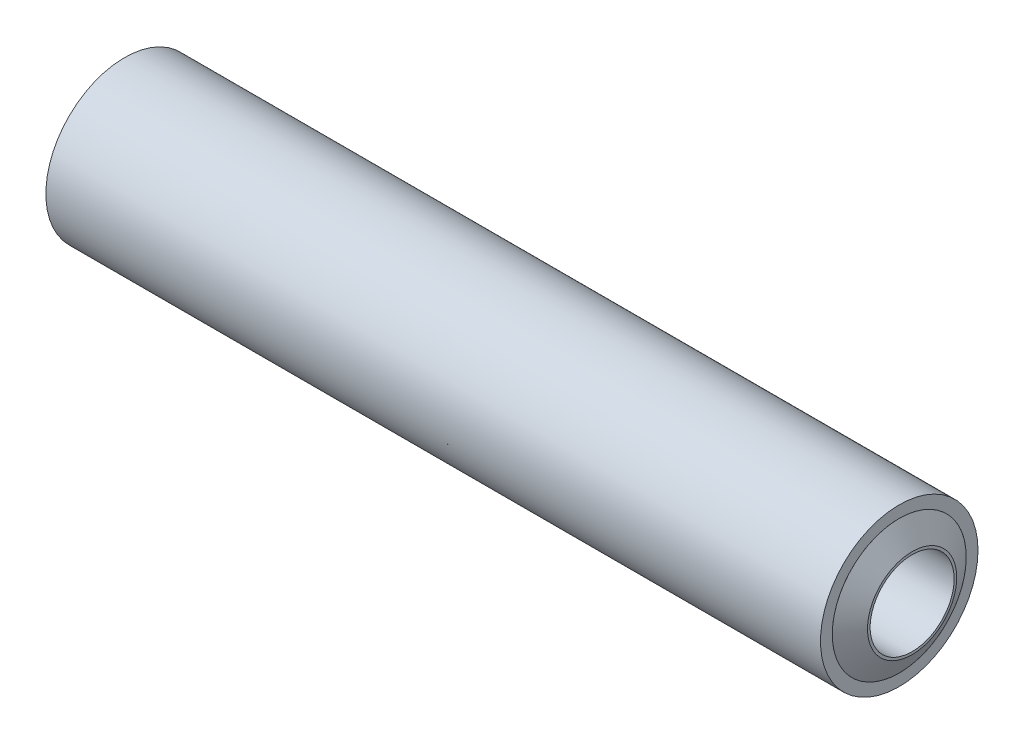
ISO-10303-21;
HEADER;
FILE_DESCRIPTION(('STEP AP214'),'2;1');
FILE_NAME('part.step','',(''),(''),'','','');
FILE_SCHEMA(('AUTOMOTIVE_DESIGN { 1 0 10303 214 1 1 1 1 }'));
ENDSEC;
DATA;
#1=APPLICATION_CONTEXT('core data for automotive mechanical design processes');
#2=APPLICATION_PROTOCOL_DEFINITION('international standard','automotive_design',2000,#1);
#3=PRODUCT_CONTEXT('',#1,'mechanical');
#4=PRODUCT('Part','Part','',(#3));
#5=PRODUCT_RELATED_PRODUCT_CATEGORY('part','',(#4));
#6=PRODUCT_DEFINITION_FORMATION('','',#4);
#7=PRODUCT_DEFINITION_CONTEXT('part definition',#1,'design');
#8=PRODUCT_DEFINITION('design','',#6,#7);
#9=PRODUCT_DEFINITION_SHAPE('','',#8);
#10=(LENGTH_UNIT() NAMED_UNIT(*) SI_UNIT(.MILLI.,.METRE.));
#11=(NAMED_UNIT(*) PLANE_ANGLE_UNIT() SI_UNIT($,.RADIAN.));
#12=(NAMED_UNIT(*) SI_UNIT($,.STERADIAN.) SOLID_ANGLE_UNIT());
#13=UNCERTAINTY_MEASURE_WITH_UNIT(LENGTH_MEASURE(1.E-05),#10,'distance_accuracy_value','');
#14=(GEOMETRIC_REPRESENTATION_CONTEXT(3) GLOBAL_UNCERTAINTY_ASSIGNED_CONTEXT((#13)) GLOBAL_UNIT_ASSIGNED_CONTEXT((#10,
#11,#12)) REPRESENTATION_CONTEXT('',''));
#15=CARTESIAN_POINT('',(0.,0.,0.));
#16=DIRECTION('',(0.,0.,1.));
#17=DIRECTION('',(1.,0.,0.));
#18=AXIS2_PLACEMENT_3D('',#15,#16,#17);
#19=CARTESIAN_POINT('',(-15.,0.,0.));
#20=DIRECTION('',(1.,0.,0.));
#21=DIRECTION('',(0.,0.,-1.));
#22=AXIS2_PLACEMENT_3D('',#19,#20,#21);
#23=CYLINDRICAL_SURFACE('',#22,3.);
#24=CARTESIAN_POINT('',(14.50925227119,0.,0.));
#25=DIRECTION('',(1.,0.,0.));
#26=DIRECTION('',(0.,0.,-1.));
#27=AXIS2_PLACEMENT_3D('',#24,#25,#26);
#28=CIRCLE('',#27,3.);
#29=CARTESIAN_POINT('',(14.50925227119,0.,-3.));
#30=VERTEX_POINT('',#29);
#31=EDGE_CURVE('P0_E21',#30,#30,#28,.F.);
#32=ORIENTED_EDGE('',*,*,#31,.T.);
#33=EDGE_LOOP('',(#32));
#34=FACE_BOUND('',#33,.T.);
#35=CARTESIAN_POINT('',(-15.,0.,0.));
#36=DIRECTION('',(1.,0.,0.));
#37=DIRECTION('',(0.,0.,-1.));
#38=AXIS2_PLACEMENT_3D('',#35,#36,#37);
#39=CIRCLE('',#38,3.);
#40=CARTESIAN_POINT('',(-15.,0.,-3.));
#41=VERTEX_POINT('',#40);
#42=EDGE_CURVE('P0_E11',#41,#41,#39,.T.);
#43=ORIENTED_EDGE('',*,*,#42,.T.);
#44=EDGE_LOOP('',(#43));
#45=FACE_BOUND('',#44,.T.);
#46=ADVANCED_FACE('P0_F17',(#34,#45),#23,.T.);
#47=CARTESIAN_POINT('',(14.50925227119,0.,0.));
#48=DIRECTION('',(1.,0.,0.));
#49=DIRECTION('',(0.,0.,-1.));
#50=AXIS2_PLACEMENT_3D('',#47,#48,#49);
#51=PLANE('',#50);
#52=CARTESIAN_POINT('',(14.50925227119,2.55,0.));
#53=CARTESIAN_POINT('',(14.50925227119,2.5497975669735,-0.486640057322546));
#54=CARTESIAN_POINT('',(14.50925227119,2.3709601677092,-0.938641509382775));
#55=CARTESIAN_POINT('',(14.50925227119,2.17685478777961,-1.42923192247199));
#56=CARTESIAN_POINT('',(14.50925227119,1.8031222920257,-1.8031222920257));
#57=CARTESIAN_POINT('',(14.50925227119,1.43013482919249,-2.17626731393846));
#58=CARTESIAN_POINT('',(14.50925227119,0.938641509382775,-2.3709601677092));
#59=CARTESIAN_POINT('',(14.50925227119,0.486919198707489,-2.54989872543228));
#60=CARTESIAN_POINT('',(14.50925227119,0.,-2.55));
#61=CARTESIAN_POINT('',(14.50925227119,-0.485873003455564,-2.55010105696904));
#62=CARTESIAN_POINT('',(14.50925227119,-0.938641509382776,-2.3709601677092));
#63=CARTESIAN_POINT('',(14.50925227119,-1.42923192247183,-2.17685478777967));
#64=CARTESIAN_POINT('',(14.50925227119,-1.8031222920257,-1.8031222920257));
#65=CARTESIAN_POINT('',(14.50925227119,-2.1762673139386,-1.43013482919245));
#66=CARTESIAN_POINT('',(14.50925227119,-2.3709601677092,-0.938641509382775));
#67=CARTESIAN_POINT('',(14.50925227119,-2.54979734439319,-0.487175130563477));
#68=CARTESIAN_POINT('',(14.50925227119,-2.55,0.));
#69=B_SPLINE_CURVE_WITH_KNOTS('',2,(#52,#53,#54,#55,#56,#57,#58,#59,#60,#61,#62,#63,#64,#65,#66,
#67,#68),.UNSPECIFIED.,.F.,.F.,(3,2,2,2,2,2,2,2,3),(0.,0.125,0.25,0.375,0.5,0.625,0.75,0.875,
1.),.UNSPECIFIED.);
#70=CARTESIAN_POINT('',(14.50925227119,2.55,0.));
#71=VERTEX_POINT('',#70);
#72=CARTESIAN_POINT('',(14.50925227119,-2.55,0.));
#73=VERTEX_POINT('',#72);
#74=EDGE_CURVE('P0_E34',#71,#73,#69,.T.);
#75=ORIENTED_EDGE('',*,*,#74,.T.);
#76=CARTESIAN_POINT('',(14.50925227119,-2.55,0.));
#77=CARTESIAN_POINT('',(14.50925227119,-2.5497975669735,0.486640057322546));
#78=CARTESIAN_POINT('',(14.50925227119,-2.3709601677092,0.938641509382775));
#79=CARTESIAN_POINT('',(14.50925227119,-2.17685478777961,1.42923192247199));
#80=CARTESIAN_POINT('',(14.50925227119,-1.8031222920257,1.8031222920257));
#81=CARTESIAN_POINT('',(14.50925227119,-1.43013482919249,2.17626731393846));
#82=CARTESIAN_POINT('',(14.50925227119,-0.938641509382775,2.3709601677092));
#83=CARTESIAN_POINT('',(14.50925227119,-0.486919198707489,2.54989872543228));
#84=CARTESIAN_POINT('',(14.50925227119,0.,2.55));
#85=CARTESIAN_POINT('',(14.50925227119,0.485873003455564,2.55010105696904));
#86=CARTESIAN_POINT('',(14.50925227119,0.938641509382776,2.3709601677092));
#87=CARTESIAN_POINT('',(14.50925227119,1.42923192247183,2.17685478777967));
#88=CARTESIAN_POINT('',(14.50925227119,1.8031222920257,1.8031222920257));
#89=CARTESIAN_POINT('',(14.50925227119,2.1762673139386,1.43013482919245));
#90=CARTESIAN_POINT('',(14.50925227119,2.3709601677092,0.938641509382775));
#91=CARTESIAN_POINT('',(14.50925227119,2.54979734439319,0.487175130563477));
#92=CARTESIAN_POINT('',(14.50925227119,2.55,0.));
#93=B_SPLINE_CURVE_WITH_KNOTS('',2,(#76,#77,#78,#79,#80,#81,#82,#83,#84,#85,#86,#87,#88,#89,#90,
#91,#92),.UNSPECIFIED.,.F.,.F.,(3,2,2,2,2,2,2,2,3),(0.,0.125,0.25,0.375,0.5,0.625,0.75,0.875,
1.),.UNSPECIFIED.);
#94=EDGE_CURVE('P0_E37',#73,#71,#93,.T.);
#95=ORIENTED_EDGE('',*,*,#94,.T.);
#96=EDGE_LOOP('',(#75,#95));
#97=FACE_BOUND('',#96,.T.);
#98=ORIENTED_EDGE('',*,*,#31,.F.);
#99=EDGE_LOOP('',(#98));
#100=FACE_BOUND('',#99,.T.);
#101=ADVANCED_FACE('P0_F18',(#97,#100),#51,.T.);
#102=OPEN_SHELL('',(#46,#101));
#103=SHELL_BASED_SURFACE_MODEL('P0_B1',(#102));
#104=CARTESIAN_POINT('',(15.,0.,0.));
#105=DIRECTION('',(1.,0.,0.));
#106=DIRECTION('',(0.,0.,-1.));
#107=AXIS2_PLACEMENT_3D('',#104,#105,#106);
#108=PLANE('',#107);
#109=CARTESIAN_POINT('',(15.,0.,0.));
#110=DIRECTION('',(1.,0.,0.));
#111=DIRECTION('',(0.,0.,-1.));
#112=AXIS2_PLACEMENT_3D('',#109,#110,#111);
#113=CIRCLE('',#112,1.6);
#114=CARTESIAN_POINT('',(15.,0.,-1.6));
#115=VERTEX_POINT('',#114);
#116=EDGE_CURVE('P1_E18',#115,#115,#113,.F.);
#117=ORIENTED_EDGE('',*,*,#116,.T.);
#118=EDGE_LOOP('',(#117));
#119=FACE_BOUND('',#118,.T.);
#120=CARTESIAN_POINT('',(14.9999999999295,0.,0.));
#121=DIRECTION('',(-1.,0.,0.));
#122=DIRECTION('',(0.,0.,1.));
#123=AXIS2_PLACEMENT_3D('',#120,#121,#122);
#124=CIRCLE('',#123,1.70000000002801);
#125=CARTESIAN_POINT('',(14.9999999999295,0.,1.70000000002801));
#126=VERTEX_POINT('',#125);
#127=EDGE_CURVE('P1_E35',#126,#126,#124,.T.);
#128=ORIENTED_EDGE('',*,*,#127,.F.);
#129=EDGE_LOOP('',(#128));
#130=FACE_BOUND('',#129,.T.);
#131=ADVANCED_FACE('P1_F15',(#119,#130),#108,.T.);
#132=CARTESIAN_POINT('',(-16.5,0.,0.));
#133=DIRECTION('',(1.,0.,0.));
#134=DIRECTION('',(0.,0.,-1.));
#135=AXIS2_PLACEMENT_3D('',#132,#133,#134);
#136=CYLINDRICAL_SURFACE('',#135,1.6);
#137=ORIENTED_EDGE('',*,*,#116,.F.);
#138=EDGE_LOOP('',(#137));
#139=FACE_BOUND('',#138,.T.);
#140=CARTESIAN_POINT('',(-15.,0.,0.));
#141=DIRECTION('',(1.,0.,0.));
#142=DIRECTION('',(0.,0.,-1.));
#143=AXIS2_PLACEMENT_3D('',#140,#141,#142);
#144=CIRCLE('',#143,1.6);
#145=CARTESIAN_POINT('',(-15.,0.,-1.6));
#146=VERTEX_POINT('',#145);
#147=EDGE_CURVE('P1_E31',#146,#146,#144,.F.);
#148=ORIENTED_EDGE('',*,*,#147,.T.);
#149=EDGE_LOOP('',(#148));
#150=FACE_BOUND('',#149,.T.);
#151=ADVANCED_FACE('P1_F46',(#139,#150),#136,.F.);
#152=CARTESIAN_POINT('',(14.509252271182,0.,0.));
#153=DIRECTION('',(-1.,0.,0.));
#154=DIRECTION('',(0.,0.,1.));
#155=AXIS2_PLACEMENT_3D('',#152,#153,#154);
#156=CONICAL_SURFACE('',#155,2.54999999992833,1.04719755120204);
#157=CARTESIAN_POINT('',(14.50925227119,0.,0.));
#158=DIRECTION('',(1.,0.,0.));
#159=DIRECTION('',(0.,0.,-1.));
#160=AXIS2_PLACEMENT_3D('',#157,#158,#159);
#161=CIRCLE('',#160,2.55);
#162=CARTESIAN_POINT('',(14.50925227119,0.,-2.55));
#163=VERTEX_POINT('',#162);
#164=EDGE_CURVE('P1_E23',#163,#163,#161,.F.);
#165=ORIENTED_EDGE('',*,*,#164,.F.);
#166=EDGE_LOOP('',(#165));
#167=FACE_BOUND('',#166,.T.);
#168=ORIENTED_EDGE('',*,*,#127,.T.);
#169=EDGE_LOOP('',(#168));
#170=FACE_BOUND('',#169,.T.);
#171=ADVANCED_FACE('P1_F49',(#167,#170),#156,.T.);
#172=CARTESIAN_POINT('',(-15.,0.,0.));
#173=DIRECTION('',(1.,0.,0.));
#174=DIRECTION('',(0.,0.,-1.));
#175=AXIS2_PLACEMENT_3D('',#172,#173,#174);
#176=PLANE('',#175);
#177=ORIENTED_EDGE('',*,*,#147,.F.);
#178=EDGE_LOOP('',(#177));
#179=FACE_BOUND('',#178,.T.);
#180=CARTESIAN_POINT('',(-15.,0.,0.));
#181=DIRECTION('',(1.,0.,0.));
#182=DIRECTION('',(0.,0.,-1.));
#183=AXIS2_PLACEMENT_3D('',#180,#181,#182);
#184=CIRCLE('',#183,2.55);
#185=CARTESIAN_POINT('',(-15.,0.,-2.55));
#186=VERTEX_POINT('',#185);
#187=EDGE_CURVE('P1_E10',#186,#186,#184,.T.);
#188=ORIENTED_EDGE('',*,*,#187,.F.);
#189=EDGE_LOOP('',(#188));
#190=FACE_BOUND('',#189,.T.);
#191=ADVANCED_FACE('P1_F52',(#179,#190),#176,.F.);
#192=CARTESIAN_POINT('',(-16.5,0.,0.));
#193=DIRECTION('',(1.,0.,0.));
#194=DIRECTION('',(0.,0.,-1.));
#195=AXIS2_PLACEMENT_3D('',#192,#193,#194);
#196=CYLINDRICAL_SURFACE('',#195,2.55);
#197=ORIENTED_EDGE('',*,*,#187,.T.);
#198=EDGE_LOOP('',(#197));
#199=FACE_BOUND('',#198,.T.);
#200=ORIENTED_EDGE('',*,*,#164,.T.);
#201=EDGE_LOOP('',(#200));
#202=FACE_BOUND('',#201,.T.);
#203=ADVANCED_FACE('P1_F55',(#199,#202),#196,.T.);
#204=CLOSED_SHELL('',(#131,#151,#171,#191,#203));
#205=MANIFOLD_SOLID_BREP('P1_B1',#204);
#206=ADVANCED_BREP_SHAPE_REPRESENTATION('',(#18,#205),#14);
#207=MANIFOLD_SURFACE_SHAPE_REPRESENTATION('',(#18,#103),#14);
#208=SHAPE_REPRESENTATION('',(#18),#14);
#209=SHAPE_DEFINITION_REPRESENTATION(#9,#208);
#210=SHAPE_REPRESENTATION_RELATIONSHIP('','',#208,#206);
#211=SHAPE_REPRESENTATION_RELATIONSHIP('','',#208,#207);
ENDSEC;
END-ISO-10303-21;
